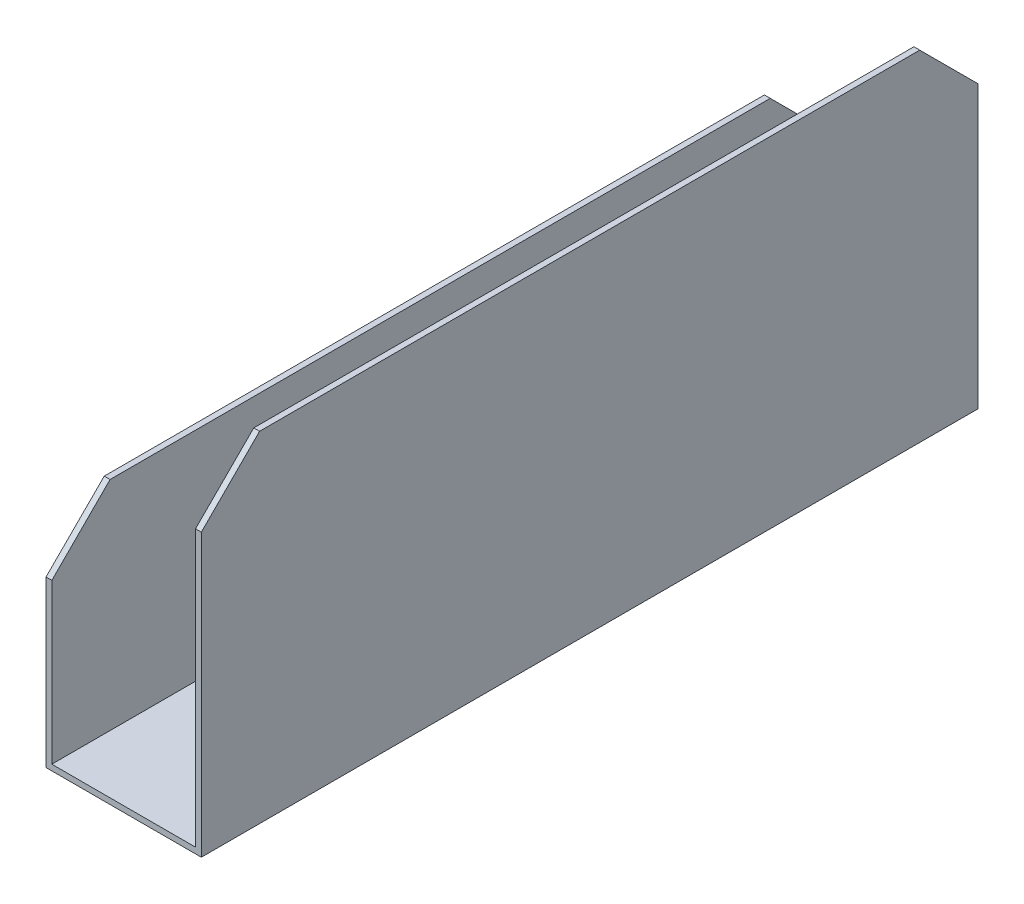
ISO-10303-21;
HEADER;
FILE_DESCRIPTION(('STEP AP214'),'2;1');
FILE_NAME('part.step','',(''),(''),'','','');
FILE_SCHEMA(('AUTOMOTIVE_DESIGN { 1 0 10303 214 1 1 1 1 }'));
ENDSEC;
DATA;
#1=APPLICATION_CONTEXT('core data for automotive mechanical design processes');
#2=APPLICATION_PROTOCOL_DEFINITION('international standard','automotive_design',2000,#1);
#3=PRODUCT_CONTEXT('',#1,'mechanical');
#4=PRODUCT('Part','Part','',(#3));
#5=PRODUCT_RELATED_PRODUCT_CATEGORY('part','',(#4));
#6=PRODUCT_DEFINITION_FORMATION('','',#4);
#7=PRODUCT_DEFINITION_CONTEXT('part definition',#1,'design');
#8=PRODUCT_DEFINITION('design','',#6,#7);
#9=PRODUCT_DEFINITION_SHAPE('','',#8);
#10=(LENGTH_UNIT() NAMED_UNIT(*) SI_UNIT(.MILLI.,.METRE.));
#11=(NAMED_UNIT(*) PLANE_ANGLE_UNIT() SI_UNIT($,.RADIAN.));
#12=(NAMED_UNIT(*) SI_UNIT($,.STERADIAN.) SOLID_ANGLE_UNIT());
#13=UNCERTAINTY_MEASURE_WITH_UNIT(LENGTH_MEASURE(1.E-05),#10,'distance_accuracy_value','');
#14=(GEOMETRIC_REPRESENTATION_CONTEXT(3) GLOBAL_UNCERTAINTY_ASSIGNED_CONTEXT((#13)) GLOBAL_UNIT_ASSIGNED_CONTEXT((#10,
#11,#12)) REPRESENTATION_CONTEXT('',''));
#15=CARTESIAN_POINT('',(0.,0.,0.));
#16=DIRECTION('',(0.,0.,1.));
#17=DIRECTION('',(1.,0.,0.));
#18=AXIS2_PLACEMENT_3D('',#15,#16,#17);
#19=CARTESIAN_POINT('',(0.,56.,200.));
#20=DIRECTION('',(0.,-1.,0.));
#21=DIRECTION('',(0.,0.,-1.));
#22=AXIS2_PLACEMENT_3D('',#19,#20,#21);
#23=PLANE('',#22);
#24=DIRECTION('',(0.,0.,-1.));
#25=VECTOR('',#24,1.);
#26=CARTESIAN_POINT('',(0.,56.,200.));
#27=LINE('',#26,#25);
#28=CARTESIAN_POINT('',(0.,56.,185.));
#29=VERTEX_POINT('',#28);
#30=CARTESIAN_POINT('',(0.,56.,15.0000000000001));
#31=VERTEX_POINT('',#30);
#32=EDGE_CURVE('E167',#29,#31,#27,.T.);
#33=ORIENTED_EDGE('',*,*,#32,.T.);
#34=DIRECTION('',(-1.,0.,0.));
#35=VECTOR('',#34,1.);
#36=CARTESIAN_POINT('',(-1.5,56.,15.));
#37=LINE('',#36,#35);
#38=CARTESIAN_POINT('',(-1.5,56.,15.0000000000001));
#39=VERTEX_POINT('',#38);
#40=EDGE_CURVE('E186',#31,#39,#37,.T.);
#41=ORIENTED_EDGE('',*,*,#40,.T.);
#42=DIRECTION('',(0.,0.,-1.));
#43=VECTOR('',#42,1.);
#44=CARTESIAN_POINT('',(-1.5,56.,200.));
#45=LINE('',#44,#43);
#46=CARTESIAN_POINT('',(-1.5,56.,185.));
#47=VERTEX_POINT('',#46);
#48=EDGE_CURVE('E138',#47,#39,#45,.T.);
#49=ORIENTED_EDGE('',*,*,#48,.F.);
#50=DIRECTION('',(1.,0.,0.));
#51=VECTOR('',#50,1.);
#52=CARTESIAN_POINT('',(0.,56.,185.));
#53=LINE('',#52,#51);
#54=EDGE_CURVE('E184',#47,#29,#53,.T.);
#55=ORIENTED_EDGE('',*,*,#54,.T.);
#56=EDGE_LOOP('',(#33,#41,#49,#55));
#57=FACE_BOUND('',#56,.T.);
#58=ADVANCED_FACE('F30',(#57),#23,.F.);
#59=CARTESIAN_POINT('',(-1.5,56.,200.));
#60=DIRECTION('',(1.,0.,0.));
#61=DIRECTION('',(0.,1.,0.));
#62=AXIS2_PLACEMENT_3D('',#59,#60,#61);
#63=PLANE('',#62);
#64=ORIENTED_EDGE('',*,*,#48,.T.);
#65=DIRECTION('',(0.,-0.707106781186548,-0.707106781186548));
#66=VECTOR('',#65,1.);
#67=CARTESIAN_POINT('',(-1.5,56.,15.));
#68=LINE('',#67,#66);
#69=CARTESIAN_POINT('',(-1.5,41.,0.));
#70=VERTEX_POINT('',#69);
#71=EDGE_CURVE('E127',#39,#70,#68,.T.);
#72=ORIENTED_EDGE('',*,*,#71,.T.);
#73=DIRECTION('',(0.,-1.,0.));
#74=VECTOR('',#73,1.);
#75=CARTESIAN_POINT('',(-1.5,56.,0.));
#76=LINE('',#75,#74);
#77=CARTESIAN_POINT('',(-1.5,-1.5,0.));
#78=VERTEX_POINT('',#77);
#79=EDGE_CURVE('E120',#70,#78,#76,.T.);
#80=ORIENTED_EDGE('',*,*,#79,.T.);
#81=DIRECTION('',(0.,0.,-1.));
#82=VECTOR('',#81,1.);
#83=CARTESIAN_POINT('',(-1.5,-1.5,200.));
#84=LINE('',#83,#82);
#85=CARTESIAN_POINT('',(-1.5,-1.5,200.));
#86=VERTEX_POINT('',#85);
#87=EDGE_CURVE('E125',#86,#78,#84,.T.);
#88=ORIENTED_EDGE('',*,*,#87,.F.);
#89=DIRECTION('',(0.,-1.,0.));
#90=VECTOR('',#89,1.);
#91=CARTESIAN_POINT('',(-1.5,56.,200.));
#92=LINE('',#91,#90);
#93=CARTESIAN_POINT('',(-1.5,40.9999999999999,200.));
#94=VERTEX_POINT('',#93);
#95=EDGE_CURVE('E155',#94,#86,#92,.T.);
#96=ORIENTED_EDGE('',*,*,#95,.F.);
#97=DIRECTION('',(0.,-0.707106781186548,0.707106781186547));
#98=VECTOR('',#97,1.);
#99=CARTESIAN_POINT('',(-1.5,40.9999999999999,200.));
#100=LINE('',#99,#98);
#101=EDGE_CURVE('E189',#94,#47,#100,.F.);
#102=ORIENTED_EDGE('',*,*,#101,.T.);
#103=EDGE_LOOP('',(#64,#72,#80,#88,#96,#102));
#104=FACE_BOUND('',#103,.T.);
#105=ADVANCED_FACE('F123',(#104),#63,.F.);
#106=CARTESIAN_POINT('',(-1.5,-1.5,200.));
#107=DIRECTION('',(0.,1.,0.));
#108=DIRECTION('',(0.,0.,1.));
#109=AXIS2_PLACEMENT_3D('',#106,#107,#108);
#110=PLANE('',#109);
#111=DIRECTION('',(1.,0.,0.));
#112=VECTOR('',#111,1.);
#113=CARTESIAN_POINT('',(-1.5,-1.5,0.));
#114=LINE('',#113,#112);
#115=CARTESIAN_POINT('',(38.5,-1.5,0.));
#116=VERTEX_POINT('',#115);
#117=EDGE_CURVE('E131',#78,#116,#114,.T.);
#118=ORIENTED_EDGE('',*,*,#117,.T.);
#119=DIRECTION('',(0.,0.,-1.));
#120=VECTOR('',#119,1.);
#121=CARTESIAN_POINT('',(38.5,-1.5,200.));
#122=LINE('',#121,#120);
#123=CARTESIAN_POINT('',(38.5,-1.5,200.));
#124=VERTEX_POINT('',#123);
#125=EDGE_CURVE('E139',#124,#116,#122,.T.);
#126=ORIENTED_EDGE('',*,*,#125,.F.);
#127=DIRECTION('',(1.,0.,0.));
#128=VECTOR('',#127,1.);
#129=CARTESIAN_POINT('',(-1.5,-1.5,200.));
#130=LINE('',#129,#128);
#131=EDGE_CURVE('E137',#86,#124,#130,.T.);
#132=ORIENTED_EDGE('',*,*,#131,.F.);
#133=ORIENTED_EDGE('',*,*,#87,.T.);
#134=EDGE_LOOP('',(#118,#126,#132,#133));
#135=FACE_BOUND('',#134,.T.);
#136=ADVANCED_FACE('F134',(#135),#110,.F.);
#137=CARTESIAN_POINT('',(38.5,-1.5,200.));
#138=DIRECTION('',(-1.,0.,0.));
#139=DIRECTION('',(0.,0.,1.));
#140=AXIS2_PLACEMENT_3D('',#137,#138,#139);
#141=PLANE('',#140);
#142=DIRECTION('',(0.,1.,0.));
#143=VECTOR('',#142,1.);
#144=CARTESIAN_POINT('',(38.5,-1.5,0.));
#145=LINE('',#144,#143);
#146=CARTESIAN_POINT('',(38.5,70.9999999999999,0.));
#147=VERTEX_POINT('',#146);
#148=EDGE_CURVE('E144',#116,#147,#145,.T.);
#149=ORIENTED_EDGE('',*,*,#148,.T.);
#150=DIRECTION('',(0.,0.707106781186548,0.707106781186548));
#151=VECTOR('',#150,1.);
#152=CARTESIAN_POINT('',(38.5,86.,15.0000000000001));
#153=LINE('',#152,#151);
#154=CARTESIAN_POINT('',(38.5,86.,15.0000000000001));
#155=VERTEX_POINT('',#154);
#156=EDGE_CURVE('E209',#147,#155,#153,.T.);
#157=ORIENTED_EDGE('',*,*,#156,.T.);
#158=DIRECTION('',(0.,0.,-1.));
#159=VECTOR('',#158,1.);
#160=CARTESIAN_POINT('',(38.5,86.,200.));
#161=LINE('',#160,#159);
#162=CARTESIAN_POINT('',(38.5,86.,185.));
#163=VERTEX_POINT('',#162);
#164=EDGE_CURVE('E179',#163,#155,#161,.T.);
#165=ORIENTED_EDGE('',*,*,#164,.F.);
#166=DIRECTION('',(0.,0.707106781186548,-0.707106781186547));
#167=VECTOR('',#166,1.);
#168=CARTESIAN_POINT('',(38.5,70.9999999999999,200.));
#169=LINE('',#168,#167);
#170=CARTESIAN_POINT('',(38.5,70.9999999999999,200.));
#171=VERTEX_POINT('',#170);
#172=EDGE_CURVE('E44',#163,#171,#169,.F.);
#173=ORIENTED_EDGE('',*,*,#172,.T.);
#174=DIRECTION('',(0.,1.,0.));
#175=VECTOR('',#174,1.);
#176=CARTESIAN_POINT('',(38.5,-1.5,200.));
#177=LINE('',#176,#175);
#178=EDGE_CURVE('E158',#124,#171,#177,.T.);
#179=ORIENTED_EDGE('',*,*,#178,.F.);
#180=ORIENTED_EDGE('',*,*,#125,.T.);
#181=EDGE_LOOP('',(#149,#157,#165,#173,#179,#180));
#182=FACE_BOUND('',#181,.T.);
#183=ADVANCED_FACE('F242',(#182),#141,.F.);
#184=CARTESIAN_POINT('',(38.5,86.,200.));
#185=DIRECTION('',(0.,-1.,0.));
#186=DIRECTION('',(0.,0.,-1.));
#187=AXIS2_PLACEMENT_3D('',#184,#185,#186);
#188=PLANE('',#187);
#189=ORIENTED_EDGE('',*,*,#164,.T.);
#190=DIRECTION('',(-1.,0.,0.));
#191=VECTOR('',#190,1.);
#192=CARTESIAN_POINT('',(37.,86.,15.0000000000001));
#193=LINE('',#192,#191);
#194=CARTESIAN_POINT('',(37.,86.,15.0000000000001));
#195=VERTEX_POINT('',#194);
#196=EDGE_CURVE('E202',#155,#195,#193,.T.);
#197=ORIENTED_EDGE('',*,*,#196,.T.);
#198=DIRECTION('',(0.,0.,-1.));
#199=VECTOR('',#198,1.);
#200=CARTESIAN_POINT('',(37.,86.,200.));
#201=LINE('',#200,#199);
#202=CARTESIAN_POINT('',(37.,86.,185.));
#203=VERTEX_POINT('',#202);
#204=EDGE_CURVE('E176',#203,#195,#201,.T.);
#205=ORIENTED_EDGE('',*,*,#204,.F.);
#206=DIRECTION('',(1.,0.,0.));
#207=VECTOR('',#206,1.);
#208=CARTESIAN_POINT('',(38.5,86.,185.));
#209=LINE('',#208,#207);
#210=EDGE_CURVE('E200',#203,#163,#209,.T.);
#211=ORIENTED_EDGE('',*,*,#210,.T.);
#212=EDGE_LOOP('',(#189,#197,#205,#211));
#213=FACE_BOUND('',#212,.T.);
#214=ADVANCED_FACE('F244',(#213),#188,.F.);
#215=CARTESIAN_POINT('',(37.,0.,200.));
#216=DIRECTION('',(1.,0.,0.));
#217=DIRECTION('',(0.,0.,-1.));
#218=AXIS2_PLACEMENT_3D('',#215,#216,#217);
#219=PLANE('',#218);
#220=ORIENTED_EDGE('',*,*,#204,.T.);
#221=DIRECTION('',(0.,-0.707106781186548,-0.707106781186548));
#222=VECTOR('',#221,1.);
#223=CARTESIAN_POINT('',(37.,86.,15.0000000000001));
#224=LINE('',#223,#222);
#225=CARTESIAN_POINT('',(37.,70.9999999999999,0.));
#226=VERTEX_POINT('',#225);
#227=EDGE_CURVE('E206',#195,#226,#224,.T.);
#228=ORIENTED_EDGE('',*,*,#227,.T.);
#229=DIRECTION('',(0.,-1.,0.));
#230=VECTOR('',#229,1.);
#231=CARTESIAN_POINT('',(37.,0.,0.));
#232=LINE('',#231,#230);
#233=CARTESIAN_POINT('',(37.,0.,0.));
#234=VERTEX_POINT('',#233);
#235=EDGE_CURVE('E146',#226,#234,#232,.T.);
#236=ORIENTED_EDGE('',*,*,#235,.T.);
#237=DIRECTION('',(0.,0.,-1.));
#238=VECTOR('',#237,1.);
#239=CARTESIAN_POINT('',(37.,0.,200.));
#240=LINE('',#239,#238);
#241=CARTESIAN_POINT('',(37.,0.,200.));
#242=VERTEX_POINT('',#241);
#243=EDGE_CURVE('E173',#242,#234,#240,.T.);
#244=ORIENTED_EDGE('',*,*,#243,.F.);
#245=DIRECTION('',(0.,-1.,0.));
#246=VECTOR('',#245,1.);
#247=CARTESIAN_POINT('',(37.,0.,200.));
#248=LINE('',#247,#246);
#249=CARTESIAN_POINT('',(37.,70.9999999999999,200.));
#250=VERTEX_POINT('',#249);
#251=EDGE_CURVE('E160',#250,#242,#248,.T.);
#252=ORIENTED_EDGE('',*,*,#251,.F.);
#253=DIRECTION('',(0.,-0.707106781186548,0.707106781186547));
#254=VECTOR('',#253,1.);
#255=CARTESIAN_POINT('',(37.,70.9999999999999,200.));
#256=LINE('',#255,#254);
#257=EDGE_CURVE('E52',#250,#203,#256,.F.);
#258=ORIENTED_EDGE('',*,*,#257,.T.);
#259=EDGE_LOOP('',(#220,#228,#236,#244,#252,#258));
#260=FACE_BOUND('',#259,.T.);
#261=ADVANCED_FACE('F248',(#260),#219,.F.);
#262=CARTESIAN_POINT('',(0.,0.,200.));
#263=DIRECTION('',(0.,-1.,0.));
#264=DIRECTION('',(0.,0.,-1.));
#265=AXIS2_PLACEMENT_3D('',#262,#263,#264);
#266=PLANE('',#265);
#267=DIRECTION('',(-1.,0.,0.));
#268=VECTOR('',#267,1.);
#269=CARTESIAN_POINT('',(0.,0.,0.));
#270=LINE('',#269,#268);
#271=CARTESIAN_POINT('',(0.,0.,0.));
#272=VERTEX_POINT('',#271);
#273=EDGE_CURVE('E150',#234,#272,#270,.T.);
#274=ORIENTED_EDGE('',*,*,#273,.T.);
#275=DIRECTION('',(0.,0.,-1.));
#276=VECTOR('',#275,1.);
#277=CARTESIAN_POINT('',(0.,0.,200.));
#278=LINE('',#277,#276);
#279=CARTESIAN_POINT('',(0.,0.,200.));
#280=VERTEX_POINT('',#279);
#281=EDGE_CURVE('E170',#280,#272,#278,.T.);
#282=ORIENTED_EDGE('',*,*,#281,.F.);
#283=DIRECTION('',(-1.,0.,0.));
#284=VECTOR('',#283,1.);
#285=CARTESIAN_POINT('',(0.,0.,200.));
#286=LINE('',#285,#284);
#287=EDGE_CURVE('E162',#242,#280,#286,.T.);
#288=ORIENTED_EDGE('',*,*,#287,.F.);
#289=ORIENTED_EDGE('',*,*,#243,.T.);
#290=EDGE_LOOP('',(#274,#282,#288,#289));
#291=FACE_BOUND('',#290,.T.);
#292=ADVANCED_FACE('F233',(#291),#266,.F.);
#293=CARTESIAN_POINT('',(0.,56.,200.));
#294=DIRECTION('',(-1.,0.,0.));
#295=DIRECTION('',(0.,-1.,0.));
#296=AXIS2_PLACEMENT_3D('',#293,#294,#295);
#297=PLANE('',#296);
#298=DIRECTION('',(0.,1.,0.));
#299=VECTOR('',#298,1.);
#300=CARTESIAN_POINT('',(0.,56.,0.));
#301=LINE('',#300,#299);
#302=CARTESIAN_POINT('',(0.,41.,0.));
#303=VERTEX_POINT('',#302);
#304=EDGE_CURVE('E152',#272,#303,#301,.T.);
#305=ORIENTED_EDGE('',*,*,#304,.T.);
#306=DIRECTION('',(0.,0.707106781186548,0.707106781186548));
#307=VECTOR('',#306,1.);
#308=CARTESIAN_POINT('',(0.,56.,15.));
#309=LINE('',#308,#307);
#310=EDGE_CURVE('E198',#303,#31,#309,.T.);
#311=ORIENTED_EDGE('',*,*,#310,.T.);
#312=ORIENTED_EDGE('',*,*,#32,.F.);
#313=DIRECTION('',(0.,0.707106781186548,-0.707106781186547));
#314=VECTOR('',#313,1.);
#315=CARTESIAN_POINT('',(0.,40.9999999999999,200.));
#316=LINE('',#315,#314);
#317=CARTESIAN_POINT('',(0.,40.9999999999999,200.));
#318=VERTEX_POINT('',#317);
#319=EDGE_CURVE('E196',#29,#318,#316,.F.);
#320=ORIENTED_EDGE('',*,*,#319,.T.);
#321=DIRECTION('',(0.,1.,0.));
#322=VECTOR('',#321,1.);
#323=CARTESIAN_POINT('',(0.,56.,200.));
#324=LINE('',#323,#322);
#325=EDGE_CURVE('E164',#280,#318,#324,.T.);
#326=ORIENTED_EDGE('',*,*,#325,.F.);
#327=ORIENTED_EDGE('',*,*,#281,.T.);
#328=EDGE_LOOP('',(#305,#311,#312,#320,#326,#327));
#329=FACE_BOUND('',#328,.T.);
#330=ADVANCED_FACE('F224',(#329),#297,.F.);
#331=CARTESIAN_POINT('',(38.5,56.,200.));
#332=DIRECTION('',(0.,0.,-1.));
#333=DIRECTION('',(-1.,0.,0.));
#334=AXIS2_PLACEMENT_3D('',#331,#332,#333);
#335=PLANE('',#334);
#336=ORIENTED_EDGE('',*,*,#178,.T.);
#337=DIRECTION('',(-1.,0.,0.));
#338=VECTOR('',#337,1.);
#339=CARTESIAN_POINT('',(38.5,70.9999999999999,200.));
#340=LINE('',#339,#338);
#341=EDGE_CURVE('E11',#171,#250,#340,.T.);
#342=ORIENTED_EDGE('',*,*,#341,.T.);
#343=ORIENTED_EDGE('',*,*,#251,.T.);
#344=ORIENTED_EDGE('',*,*,#287,.T.);
#345=ORIENTED_EDGE('',*,*,#325,.T.);
#346=DIRECTION('',(-1.,0.,0.));
#347=VECTOR('',#346,1.);
#348=CARTESIAN_POINT('',(38.5,40.9999999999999,200.));
#349=LINE('',#348,#347);
#350=EDGE_CURVE('E37',#318,#94,#349,.T.);
#351=ORIENTED_EDGE('',*,*,#350,.T.);
#352=ORIENTED_EDGE('',*,*,#95,.T.);
#353=ORIENTED_EDGE('',*,*,#131,.T.);
#354=EDGE_LOOP('',(#336,#342,#343,#344,#345,#351,#352,#353));
#355=FACE_BOUND('',#354,.T.);
#356=ADVANCED_FACE('F213',(#355),#335,.F.);
#357=CARTESIAN_POINT('',(38.5,56.,0.));
#358=DIRECTION('',(0.,0.,-1.));
#359=DIRECTION('',(-1.,0.,0.));
#360=AXIS2_PLACEMENT_3D('',#357,#358,#359);
#361=PLANE('',#360);
#362=ORIENTED_EDGE('',*,*,#79,.F.);
#363=DIRECTION('',(1.,0.,0.));
#364=VECTOR('',#363,1.);
#365=CARTESIAN_POINT('',(0.,41.,0.));
#366=LINE('',#365,#364);
#367=EDGE_CURVE('E194',#70,#303,#366,.T.);
#368=ORIENTED_EDGE('',*,*,#367,.T.);
#369=ORIENTED_EDGE('',*,*,#304,.F.);
#370=ORIENTED_EDGE('',*,*,#273,.F.);
#371=ORIENTED_EDGE('',*,*,#235,.F.);
#372=DIRECTION('',(1.,0.,0.));
#373=VECTOR('',#372,1.);
#374=CARTESIAN_POINT('',(38.5,70.9999999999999,0.));
#375=LINE('',#374,#373);
#376=EDGE_CURVE('E192',#226,#147,#375,.T.);
#377=ORIENTED_EDGE('',*,*,#376,.T.);
#378=ORIENTED_EDGE('',*,*,#148,.F.);
#379=ORIENTED_EDGE('',*,*,#117,.F.);
#380=EDGE_LOOP('',(#362,#368,#369,#370,#371,#377,#378,#379));
#381=FACE_BOUND('',#380,.T.);
#382=ADVANCED_FACE('F142',(#381),#361,.T.);
#383=CARTESIAN_POINT('',(0.,56.,15.));
#384=DIRECTION('',(0.,0.707106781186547,-0.707106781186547));
#385=DIRECTION('',(0.,0.707106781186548,0.707106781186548));
#386=AXIS2_PLACEMENT_3D('',#383,#384,#385);
#387=PLANE('',#386);
#388=ORIENTED_EDGE('',*,*,#310,.F.);
#389=ORIENTED_EDGE('',*,*,#367,.F.);
#390=ORIENTED_EDGE('',*,*,#71,.F.);
#391=ORIENTED_EDGE('',*,*,#40,.F.);
#392=EDGE_LOOP('',(#388,#389,#390,#391));
#393=FACE_BOUND('',#392,.T.);
#394=ADVANCED_FACE('F227',(#393),#387,.T.);
#395=CARTESIAN_POINT('',(38.5,86.,15.0000000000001));
#396=DIRECTION('',(0.,0.707106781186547,-0.707106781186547));
#397=DIRECTION('',(0.,0.707106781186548,0.707106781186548));
#398=AXIS2_PLACEMENT_3D('',#395,#396,#397);
#399=PLANE('',#398);
#400=ORIENTED_EDGE('',*,*,#156,.F.);
#401=ORIENTED_EDGE('',*,*,#376,.F.);
#402=ORIENTED_EDGE('',*,*,#227,.F.);
#403=ORIENTED_EDGE('',*,*,#196,.F.);
#404=EDGE_LOOP('',(#400,#401,#402,#403));
#405=FACE_BOUND('',#404,.T.);
#406=ADVANCED_FACE('F240',(#405),#399,.T.);
#407=CARTESIAN_POINT('',(38.5,70.9999999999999,200.));
#408=DIRECTION('',(0.,-0.707106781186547,-0.707106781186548));
#409=DIRECTION('',(0.,0.707106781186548,-0.707106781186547));
#410=AXIS2_PLACEMENT_3D('',#407,#408,#409);
#411=PLANE('',#410);
#412=ORIENTED_EDGE('',*,*,#172,.F.);
#413=ORIENTED_EDGE('',*,*,#210,.F.);
#414=ORIENTED_EDGE('',*,*,#257,.F.);
#415=ORIENTED_EDGE('',*,*,#341,.F.);
#416=EDGE_LOOP('',(#412,#413,#414,#415));
#417=FACE_BOUND('',#416,.T.);
#418=ADVANCED_FACE('F246',(#417),#411,.F.);
#419=CARTESIAN_POINT('',(38.5,40.9999999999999,200.));
#420=DIRECTION('',(0.,-0.707106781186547,-0.707106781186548));
#421=DIRECTION('',(0.,0.707106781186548,-0.707106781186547));
#422=AXIS2_PLACEMENT_3D('',#419,#420,#421);
#423=PLANE('',#422);
#424=ORIENTED_EDGE('',*,*,#319,.F.);
#425=ORIENTED_EDGE('',*,*,#54,.F.);
#426=ORIENTED_EDGE('',*,*,#101,.F.);
#427=ORIENTED_EDGE('',*,*,#350,.F.);
#428=EDGE_LOOP('',(#424,#425,#426,#427));
#429=FACE_BOUND('',#428,.T.);
#430=ADVANCED_FACE('F222',(#429),#423,.F.);
#431=CLOSED_SHELL('',(#58,#105,#136,#183,#214,#261,#292,#330,#356,#382,#394,#406,#418,#430));
#432=MANIFOLD_SOLID_BREP('B2',#431);
#433=ADVANCED_BREP_SHAPE_REPRESENTATION('',(#18,#432),#14);
#434=SHAPE_DEFINITION_REPRESENTATION(#9,#433);
ENDSEC;
END-ISO-10303-21;
